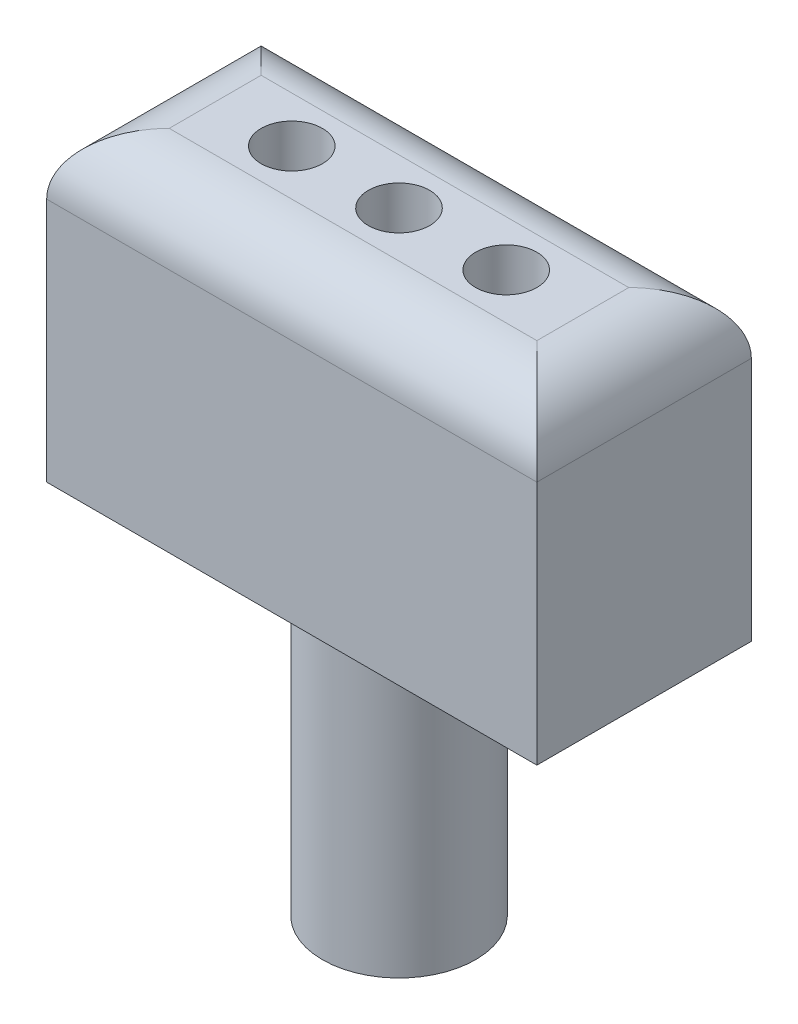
ISO-10303-21;
HEADER;
FILE_DESCRIPTION(('STEP AP214'),'2;1');
FILE_NAME('part.step','',(''),(''),'','','');
FILE_SCHEMA(('AUTOMOTIVE_DESIGN { 1 0 10303 214 1 1 1 1 }'));
ENDSEC;
DATA;
#1=APPLICATION_CONTEXT('core data for automotive mechanical design processes');
#2=APPLICATION_PROTOCOL_DEFINITION('international standard','automotive_design',2000,#1);
#3=PRODUCT_CONTEXT('',#1,'mechanical');
#4=PRODUCT('Part','Part','',(#3));
#5=PRODUCT_RELATED_PRODUCT_CATEGORY('part','',(#4));
#6=PRODUCT_DEFINITION_FORMATION('','',#4);
#7=PRODUCT_DEFINITION_CONTEXT('part definition',#1,'design');
#8=PRODUCT_DEFINITION('design','',#6,#7);
#9=PRODUCT_DEFINITION_SHAPE('','',#8);
#10=(LENGTH_UNIT() NAMED_UNIT(*) SI_UNIT(.MILLI.,.METRE.));
#11=(NAMED_UNIT(*) PLANE_ANGLE_UNIT() SI_UNIT($,.RADIAN.));
#12=(NAMED_UNIT(*) SI_UNIT($,.STERADIAN.) SOLID_ANGLE_UNIT());
#13=UNCERTAINTY_MEASURE_WITH_UNIT(LENGTH_MEASURE(1.E-05),#10,'distance_accuracy_value','');
#14=(GEOMETRIC_REPRESENTATION_CONTEXT(3) GLOBAL_UNCERTAINTY_ASSIGNED_CONTEXT((#13)) GLOBAL_UNIT_ASSIGNED_CONTEXT((#10,
#11,#12)) REPRESENTATION_CONTEXT('',''));
#15=CARTESIAN_POINT('',(0.,0.,0.));
#16=DIRECTION('',(0.,0.,1.));
#17=DIRECTION('',(1.,0.,0.));
#18=AXIS2_PLACEMENT_3D('',#15,#16,#17);
#19=CARTESIAN_POINT('',(0.,50.,0.));
#20=DIRECTION('',(0.,-1.,0.));
#21=DIRECTION('',(0.,0.,-1.));
#22=AXIS2_PLACEMENT_3D('',#19,#20,#21);
#23=CYLINDRICAL_SURFACE('',#22,12.5);
#24=CARTESIAN_POINT('',(0.,50.,0.));
#25=DIRECTION('',(0.,1.,0.));
#26=DIRECTION('',(0.,0.,1.));
#27=AXIS2_PLACEMENT_3D('',#24,#25,#26);
#28=CIRCLE('',#27,12.5);
#29=CARTESIAN_POINT('',(0.,50.,12.5));
#30=VERTEX_POINT('',#29);
#31=EDGE_CURVE('E134',#30,#30,#28,.T.);
#32=ORIENTED_EDGE('',*,*,#31,.F.);
#33=EDGE_LOOP('',(#32));
#34=FACE_BOUND('',#33,.T.);
#35=CARTESIAN_POINT('',(0.,0.,0.));
#36=DIRECTION('',(0.,1.,0.));
#37=DIRECTION('',(0.,0.,1.));
#38=AXIS2_PLACEMENT_3D('',#35,#36,#37);
#39=CIRCLE('',#38,12.5);
#40=CARTESIAN_POINT('',(0.,0.,12.5));
#41=VERTEX_POINT('',#40);
#42=EDGE_CURVE('E105',#41,#41,#39,.T.);
#43=ORIENTED_EDGE('',*,*,#42,.T.);
#44=EDGE_LOOP('',(#43));
#45=FACE_BOUND('',#44,.T.);
#46=ADVANCED_FACE('F45',(#34,#45),#23,.T.);
#47=CARTESIAN_POINT('',(0.,0.,0.));
#48=DIRECTION('',(0.,1.,0.));
#49=DIRECTION('',(0.,0.,1.));
#50=AXIS2_PLACEMENT_3D('',#47,#48,#49);
#51=PLANE('',#50);
#52=ORIENTED_EDGE('',*,*,#42,.F.);
#53=EDGE_LOOP('',(#52));
#54=FACE_BOUND('',#53,.T.);
#55=ADVANCED_FACE('F186',(#54),#51,.F.);
#56=CARTESIAN_POINT('',(40.,100.,-17.5));
#57=DIRECTION('',(-1.,0.,0.));
#58=DIRECTION('',(0.,0.,1.));
#59=AXIS2_PLACEMENT_3D('',#56,#57,#58);
#60=PLANE('',#59);
#61=DIRECTION('',(0.,-1.,0.));
#62=VECTOR('',#61,1.);
#63=CARTESIAN_POINT('',(40.,100.,-17.5));
#64=LINE('',#63,#62);
#65=CARTESIAN_POINT('',(40.,90.,-17.5));
#66=VERTEX_POINT('',#65);
#67=CARTESIAN_POINT('',(40.,50.,-17.5));
#68=VERTEX_POINT('',#67);
#69=EDGE_CURVE('E97',#66,#68,#64,.T.);
#70=ORIENTED_EDGE('',*,*,#69,.F.);
#71=DIRECTION('',(0.,0.,-1.));
#72=VECTOR('',#71,1.);
#73=CARTESIAN_POINT('',(40.,90.,17.5));
#74=LINE('',#73,#72);
#75=CARTESIAN_POINT('',(40.,90.,17.5));
#76=VERTEX_POINT('',#75);
#77=EDGE_CURVE('E11',#66,#76,#74,.F.);
#78=ORIENTED_EDGE('',*,*,#77,.T.);
#79=DIRECTION('',(0.,-1.,0.));
#80=VECTOR('',#79,1.);
#81=CARTESIAN_POINT('',(40.,100.,17.5));
#82=LINE('',#81,#80);
#83=CARTESIAN_POINT('',(40.,50.,17.5));
#84=VERTEX_POINT('',#83);
#85=EDGE_CURVE('E118',#76,#84,#82,.T.);
#86=ORIENTED_EDGE('',*,*,#85,.T.);
#87=DIRECTION('',(0.,0.,-1.));
#88=VECTOR('',#87,1.);
#89=CARTESIAN_POINT('',(40.,50.,-17.5));
#90=LINE('',#89,#88);
#91=EDGE_CURVE('E112',#84,#68,#90,.T.);
#92=ORIENTED_EDGE('',*,*,#91,.T.);
#93=EDGE_LOOP('',(#70,#78,#86,#92));
#94=FACE_BOUND('',#93,.T.);
#95=ADVANCED_FACE('F116',(#94),#60,.F.);
#96=CARTESIAN_POINT('',(-40.,100.,-17.5));
#97=DIRECTION('',(0.,0.,1.));
#98=DIRECTION('',(1.,0.,0.));
#99=AXIS2_PLACEMENT_3D('',#96,#97,#98);
#100=PLANE('',#99);
#101=DIRECTION('',(0.,-1.,0.));
#102=VECTOR('',#101,1.);
#103=CARTESIAN_POINT('',(-40.,100.,-17.5));
#104=LINE('',#103,#102);
#105=CARTESIAN_POINT('',(-40.,90.,-17.5));
#106=VERTEX_POINT('',#105);
#107=CARTESIAN_POINT('',(-40.,50.,-17.5));
#108=VERTEX_POINT('',#107);
#109=EDGE_CURVE('E106',#106,#108,#104,.T.);
#110=ORIENTED_EDGE('',*,*,#109,.F.);
#111=DIRECTION('',(-1.,0.,0.));
#112=VECTOR('',#111,1.);
#113=CARTESIAN_POINT('',(40.,90.,-17.5));
#114=LINE('',#113,#112);
#115=EDGE_CURVE('E54',#106,#66,#114,.F.);
#116=ORIENTED_EDGE('',*,*,#115,.T.);
#117=ORIENTED_EDGE('',*,*,#69,.T.);
#118=DIRECTION('',(-1.,0.,0.));
#119=VECTOR('',#118,1.);
#120=CARTESIAN_POINT('',(-40.,50.,-17.5));
#121=LINE('',#120,#119);
#122=EDGE_CURVE('E100',#68,#108,#121,.T.);
#123=ORIENTED_EDGE('',*,*,#122,.T.);
#124=EDGE_LOOP('',(#110,#116,#117,#123));
#125=FACE_BOUND('',#124,.T.);
#126=ADVANCED_FACE('F99',(#125),#100,.F.);
#127=CARTESIAN_POINT('',(-40.,100.,-17.5));
#128=DIRECTION('',(1.,0.,0.));
#129=DIRECTION('',(0.,0.,-1.));
#130=AXIS2_PLACEMENT_3D('',#127,#128,#129);
#131=PLANE('',#130);
#132=DIRECTION('',(0.,-1.,0.));
#133=VECTOR('',#132,1.);
#134=CARTESIAN_POINT('',(-40.,100.,17.5));
#135=LINE('',#134,#133);
#136=CARTESIAN_POINT('',(-40.,90.,17.5));
#137=VERTEX_POINT('',#136);
#138=CARTESIAN_POINT('',(-40.,50.,17.5));
#139=VERTEX_POINT('',#138);
#140=EDGE_CURVE('E131',#137,#139,#135,.T.);
#141=ORIENTED_EDGE('',*,*,#140,.F.);
#142=DIRECTION('',(0.,0.,1.));
#143=VECTOR('',#142,1.);
#144=CARTESIAN_POINT('',(-40.,90.,-17.5));
#145=LINE('',#144,#143);
#146=EDGE_CURVE('E69',#137,#106,#145,.F.);
#147=ORIENTED_EDGE('',*,*,#146,.T.);
#148=ORIENTED_EDGE('',*,*,#109,.T.);
#149=DIRECTION('',(0.,0.,1.));
#150=VECTOR('',#149,1.);
#151=CARTESIAN_POINT('',(-40.,50.,-17.5));
#152=LINE('',#151,#150);
#153=EDGE_CURVE('E114',#108,#139,#152,.T.);
#154=ORIENTED_EDGE('',*,*,#153,.T.);
#155=EDGE_LOOP('',(#141,#147,#148,#154));
#156=FACE_BOUND('',#155,.T.);
#157=ADVANCED_FACE('F176',(#156),#131,.F.);
#158=CARTESIAN_POINT('',(-40.,100.,17.5));
#159=DIRECTION('',(0.,0.,-1.));
#160=DIRECTION('',(-1.,0.,0.));
#161=AXIS2_PLACEMENT_3D('',#158,#159,#160);
#162=PLANE('',#161);
#163=ORIENTED_EDGE('',*,*,#85,.F.);
#164=DIRECTION('',(1.,0.,0.));
#165=VECTOR('',#164,1.);
#166=CARTESIAN_POINT('',(-40.,90.,17.5));
#167=LINE('',#166,#165);
#168=EDGE_CURVE('E148',#76,#137,#167,.F.);
#169=ORIENTED_EDGE('',*,*,#168,.T.);
#170=ORIENTED_EDGE('',*,*,#140,.T.);
#171=DIRECTION('',(1.,0.,0.));
#172=VECTOR('',#171,1.);
#173=CARTESIAN_POINT('',(-40.,50.,17.5));
#174=LINE('',#173,#172);
#175=EDGE_CURVE('E128',#139,#84,#174,.T.);
#176=ORIENTED_EDGE('',*,*,#175,.T.);
#177=EDGE_LOOP('',(#163,#169,#170,#176));
#178=FACE_BOUND('',#177,.T.);
#179=ADVANCED_FACE('F175',(#178),#162,.F.);
#180=CARTESIAN_POINT('',(0.,100.,0.));
#181=DIRECTION('',(0.,1.,0.));
#182=DIRECTION('',(0.,0.,1.));
#183=AXIS2_PLACEMENT_3D('',#180,#181,#182);
#184=PLANE('',#183);
#185=CARTESIAN_POINT('',(17.5,100.,0.));
#186=DIRECTION('',(0.,1.,0.));
#187=DIRECTION('',(0.,0.,-1.));
#188=AXIS2_PLACEMENT_3D('',#185,#186,#187);
#189=CIRCLE('',#188,5.);
#190=CARTESIAN_POINT('',(17.5,100.,-5.));
#191=VERTEX_POINT('',#190);
#192=EDGE_CURVE('E254',#191,#191,#189,.T.);
#193=ORIENTED_EDGE('',*,*,#192,.F.);
#194=EDGE_LOOP('',(#193));
#195=FACE_BOUND('',#194,.T.);
#196=CARTESIAN_POINT('',(-17.5,100.,0.));
#197=DIRECTION('',(0.,1.,0.));
#198=DIRECTION('',(0.,0.,1.));
#199=AXIS2_PLACEMENT_3D('',#196,#197,#198);
#200=CIRCLE('',#199,5.);
#201=CARTESIAN_POINT('',(-17.5,100.,5.));
#202=VERTEX_POINT('',#201);
#203=EDGE_CURVE('E250',#202,#202,#200,.T.);
#204=ORIENTED_EDGE('',*,*,#203,.F.);
#205=EDGE_LOOP('',(#204));
#206=FACE_BOUND('',#205,.T.);
#207=CARTESIAN_POINT('',(0.,100.,0.));
#208=DIRECTION('',(0.,1.,0.));
#209=DIRECTION('',(0.,0.,1.));
#210=AXIS2_PLACEMENT_3D('',#207,#208,#209);
#211=CIRCLE('',#210,5.);
#212=CARTESIAN_POINT('',(0.,100.,5.));
#213=VERTEX_POINT('',#212);
#214=EDGE_CURVE('E124',#213,#213,#211,.T.);
#215=ORIENTED_EDGE('',*,*,#214,.F.);
#216=EDGE_LOOP('',(#215));
#217=FACE_BOUND('',#216,.T.);
#218=DIRECTION('',(0.,0.,1.));
#219=VECTOR('',#218,1.);
#220=CARTESIAN_POINT('',(-30.,100.,17.5));
#221=LINE('',#220,#219);
#222=CARTESIAN_POINT('',(-30.,100.,-7.5));
#223=VERTEX_POINT('',#222);
#224=CARTESIAN_POINT('',(-30.,100.,7.50000000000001));
#225=VERTEX_POINT('',#224);
#226=EDGE_CURVE('E143',#223,#225,#221,.T.);
#227=ORIENTED_EDGE('',*,*,#226,.T.);
#228=DIRECTION('',(1.,0.,0.));
#229=VECTOR('',#228,1.);
#230=CARTESIAN_POINT('',(40.,100.,7.50000000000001));
#231=LINE('',#230,#229);
#232=CARTESIAN_POINT('',(30.,100.,7.50000000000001));
#233=VERTEX_POINT('',#232);
#234=EDGE_CURVE('E145',#225,#233,#231,.T.);
#235=ORIENTED_EDGE('',*,*,#234,.T.);
#236=DIRECTION('',(0.,0.,-1.));
#237=VECTOR('',#236,1.);
#238=CARTESIAN_POINT('',(30.,100.,-17.5));
#239=LINE('',#238,#237);
#240=CARTESIAN_POINT('',(30.,100.,-7.5));
#241=VERTEX_POINT('',#240);
#242=EDGE_CURVE('E137',#233,#241,#239,.T.);
#243=ORIENTED_EDGE('',*,*,#242,.T.);
#244=DIRECTION('',(-1.,0.,0.));
#245=VECTOR('',#244,1.);
#246=CARTESIAN_POINT('',(-40.,100.,-7.5));
#247=LINE('',#246,#245);
#248=EDGE_CURVE('E141',#241,#223,#247,.T.);
#249=ORIENTED_EDGE('',*,*,#248,.T.);
#250=EDGE_LOOP('',(#227,#235,#243,#249));
#251=FACE_BOUND('',#250,.T.);
#252=ADVANCED_FACE('F168',(#195,#206,#217,#251),#184,.T.);
#253=CARTESIAN_POINT('',(0.,50.,0.));
#254=DIRECTION('',(0.,1.,0.));
#255=DIRECTION('',(0.,0.,1.));
#256=AXIS2_PLACEMENT_3D('',#253,#254,#255);
#257=PLANE('',#256);
#258=ORIENTED_EDGE('',*,*,#31,.T.);
#259=EDGE_LOOP('',(#258));
#260=FACE_BOUND('',#259,.T.);
#261=ORIENTED_EDGE('',*,*,#91,.F.);
#262=ORIENTED_EDGE('',*,*,#175,.F.);
#263=ORIENTED_EDGE('',*,*,#153,.F.);
#264=ORIENTED_EDGE('',*,*,#122,.F.);
#265=EDGE_LOOP('',(#261,#262,#263,#264));
#266=FACE_BOUND('',#265,.T.);
#267=ADVANCED_FACE('F110',(#260,#266),#257,.F.);
#268=CARTESIAN_POINT('',(0.,90.,-7.5));
#269=DIRECTION('',(1.,0.,0.));
#270=DIRECTION('',(0.,0.,-1.));
#271=AXIS2_PLACEMENT_3D('',#268,#269,#270);
#272=CYLINDRICAL_SURFACE('',#271,10.);
#273=CARTESIAN_POINT('',(30.,90.,-7.5));
#274=DIRECTION('',(0.707106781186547,0.,0.707106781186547));
#275=DIRECTION('',(-0.707106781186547,0.,0.707106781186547));
#276=AXIS2_PLACEMENT_3D('',#273,#274,#275);
#277=ELLIPSE('',#276,14.1421356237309,10.);
#278=EDGE_CURVE('E122',#66,#241,#277,.T.);
#279=ORIENTED_EDGE('',*,*,#278,.F.);
#280=ORIENTED_EDGE('',*,*,#115,.F.);
#281=CARTESIAN_POINT('',(-30.,90.,-7.5));
#282=DIRECTION('',(0.707106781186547,0.,-0.707106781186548));
#283=DIRECTION('',(0.707106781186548,0.,0.707106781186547));
#284=AXIS2_PLACEMENT_3D('',#281,#282,#283);
#285=ELLIPSE('',#284,14.142135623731,10.);
#286=EDGE_CURVE('E49',#223,#106,#285,.F.);
#287=ORIENTED_EDGE('',*,*,#286,.F.);
#288=ORIENTED_EDGE('',*,*,#248,.F.);
#289=EDGE_LOOP('',(#279,#280,#287,#288));
#290=FACE_BOUND('',#289,.T.);
#291=ADVANCED_FACE('F47',(#290),#272,.T.);
#292=CARTESIAN_POINT('',(-30.,90.,0.));
#293=DIRECTION('',(0.,0.,-1.));
#294=DIRECTION('',(-1.,0.,0.));
#295=AXIS2_PLACEMENT_3D('',#292,#293,#294);
#296=CYLINDRICAL_SURFACE('',#295,10.);
#297=ORIENTED_EDGE('',*,*,#286,.T.);
#298=ORIENTED_EDGE('',*,*,#146,.F.);
#299=CARTESIAN_POINT('',(-30.,90.,7.50000000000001));
#300=DIRECTION('',(-0.707106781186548,0.,-0.707106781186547));
#301=DIRECTION('',(0.707106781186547,0.,-0.707106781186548));
#302=AXIS2_PLACEMENT_3D('',#299,#300,#301);
#303=ELLIPSE('',#302,14.1421356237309,10.);
#304=EDGE_CURVE('E155',#225,#137,#303,.F.);
#305=ORIENTED_EDGE('',*,*,#304,.F.);
#306=ORIENTED_EDGE('',*,*,#226,.F.);
#307=EDGE_LOOP('',(#297,#298,#305,#306));
#308=FACE_BOUND('',#307,.T.);
#309=ADVANCED_FACE('F202',(#308),#296,.T.);
#310=CARTESIAN_POINT('',(30.,90.,0.));
#311=DIRECTION('',(0.,0.,1.));
#312=DIRECTION('',(1.,0.,0.));
#313=AXIS2_PLACEMENT_3D('',#310,#311,#312);
#314=CYLINDRICAL_SURFACE('',#313,10.);
#315=ORIENTED_EDGE('',*,*,#278,.T.);
#316=ORIENTED_EDGE('',*,*,#242,.F.);
#317=CARTESIAN_POINT('',(30.,90.,7.50000000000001));
#318=DIRECTION('',(-0.707106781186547,0.,0.707106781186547));
#319=DIRECTION('',(0.707106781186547,0.,0.707106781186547));
#320=AXIS2_PLACEMENT_3D('',#317,#318,#319);
#321=ELLIPSE('',#320,14.1421356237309,10.);
#322=EDGE_CURVE('E153',#76,#233,#321,.T.);
#323=ORIENTED_EDGE('',*,*,#322,.F.);
#324=ORIENTED_EDGE('',*,*,#77,.F.);
#325=EDGE_LOOP('',(#315,#316,#323,#324));
#326=FACE_BOUND('',#325,.T.);
#327=ADVANCED_FACE('F161',(#326),#314,.T.);
#328=CARTESIAN_POINT('',(0.,90.,7.50000000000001));
#329=DIRECTION('',(-1.,0.,0.));
#330=DIRECTION('',(0.,0.,1.));
#331=AXIS2_PLACEMENT_3D('',#328,#329,#330);
#332=CYLINDRICAL_SURFACE('',#331,10.);
#333=ORIENTED_EDGE('',*,*,#304,.T.);
#334=ORIENTED_EDGE('',*,*,#168,.F.);
#335=ORIENTED_EDGE('',*,*,#322,.T.);
#336=ORIENTED_EDGE('',*,*,#234,.F.);
#337=EDGE_LOOP('',(#333,#334,#335,#336));
#338=FACE_BOUND('',#337,.T.);
#339=ADVANCED_FACE('F172',(#338),#332,.T.);
#340=CARTESIAN_POINT('',(0.,90.,0.));
#341=DIRECTION('',(0.,1.,0.));
#342=DIRECTION('',(0.,0.,1.));
#343=AXIS2_PLACEMENT_3D('',#340,#341,#342);
#344=CYLINDRICAL_SURFACE('',#343,5.);
#345=CARTESIAN_POINT('',(0.,90.,0.));
#346=DIRECTION('',(0.,1.,0.));
#347=DIRECTION('',(0.,0.,1.));
#348=AXIS2_PLACEMENT_3D('',#345,#346,#347);
#349=CIRCLE('',#348,5.);
#350=CARTESIAN_POINT('',(0.,90.,5.));
#351=VERTEX_POINT('',#350);
#352=EDGE_CURVE('E156',#351,#351,#349,.T.);
#353=ORIENTED_EDGE('',*,*,#352,.F.);
#354=EDGE_LOOP('',(#353));
#355=FACE_BOUND('',#354,.T.);
#356=ORIENTED_EDGE('',*,*,#214,.T.);
#357=EDGE_LOOP('',(#356));
#358=FACE_BOUND('',#357,.T.);
#359=ADVANCED_FACE('F200',(#355,#358),#344,.F.);
#360=CARTESIAN_POINT('',(0.,90.,0.));
#361=DIRECTION('',(0.,1.,0.));
#362=DIRECTION('',(0.,0.,1.));
#363=AXIS2_PLACEMENT_3D('',#360,#361,#362);
#364=PLANE('',#363);
#365=ORIENTED_EDGE('',*,*,#352,.T.);
#366=EDGE_LOOP('',(#365));
#367=FACE_BOUND('',#366,.T.);
#368=ADVANCED_FACE('F222',(#367),#364,.T.);
#369=CARTESIAN_POINT('',(-17.5,90.,0.));
#370=DIRECTION('',(0.,1.,0.));
#371=DIRECTION('',(0.,0.,1.));
#372=AXIS2_PLACEMENT_3D('',#369,#370,#371);
#373=CYLINDRICAL_SURFACE('',#372,5.);
#374=CARTESIAN_POINT('',(-17.5,90.,0.));
#375=DIRECTION('',(0.,1.,0.));
#376=DIRECTION('',(0.,0.,1.));
#377=AXIS2_PLACEMENT_3D('',#374,#375,#376);
#378=CIRCLE('',#377,5.);
#379=CARTESIAN_POINT('',(-17.5,90.,5.));
#380=VERTEX_POINT('',#379);
#381=EDGE_CURVE('E247',#380,#380,#378,.T.);
#382=ORIENTED_EDGE('',*,*,#381,.F.);
#383=EDGE_LOOP('',(#382));
#384=FACE_BOUND('',#383,.T.);
#385=ORIENTED_EDGE('',*,*,#203,.T.);
#386=EDGE_LOOP('',(#385));
#387=FACE_BOUND('',#386,.T.);
#388=ADVANCED_FACE('F226',(#384,#387),#373,.F.);
#389=CARTESIAN_POINT('',(-17.5,90.,0.));
#390=DIRECTION('',(0.,1.,0.));
#391=DIRECTION('',(0.,0.,1.));
#392=AXIS2_PLACEMENT_3D('',#389,#390,#391);
#393=PLANE('',#392);
#394=ORIENTED_EDGE('',*,*,#381,.T.);
#395=EDGE_LOOP('',(#394));
#396=FACE_BOUND('',#395,.T.);
#397=ADVANCED_FACE('F235',(#396),#393,.T.);
#398=CARTESIAN_POINT('',(17.5,90.,0.));
#399=DIRECTION('',(0.,1.,0.));
#400=DIRECTION('',(0.,0.,1.));
#401=AXIS2_PLACEMENT_3D('',#398,#399,#400);
#402=CYLINDRICAL_SURFACE('',#401,5.);
#403=CARTESIAN_POINT('',(17.5,90.,0.));
#404=DIRECTION('',(0.,1.,0.));
#405=DIRECTION('',(0.,0.,-1.));
#406=AXIS2_PLACEMENT_3D('',#403,#404,#405);
#407=CIRCLE('',#406,5.);
#408=CARTESIAN_POINT('',(17.5,90.,-5.));
#409=VERTEX_POINT('',#408);
#410=EDGE_CURVE('E259',#409,#409,#407,.T.);
#411=ORIENTED_EDGE('',*,*,#410,.F.);
#412=EDGE_LOOP('',(#411));
#413=FACE_BOUND('',#412,.T.);
#414=ORIENTED_EDGE('',*,*,#192,.T.);
#415=EDGE_LOOP('',(#414));
#416=FACE_BOUND('',#415,.T.);
#417=ADVANCED_FACE('F231',(#413,#416),#402,.F.);
#418=CARTESIAN_POINT('',(17.5,90.,0.));
#419=DIRECTION('',(0.,-1.,0.));
#420=DIRECTION('',(0.,0.,-1.));
#421=AXIS2_PLACEMENT_3D('',#418,#419,#420);
#422=PLANE('',#421);
#423=ORIENTED_EDGE('',*,*,#410,.T.);
#424=EDGE_LOOP('',(#423));
#425=FACE_BOUND('',#424,.T.);
#426=ADVANCED_FACE('F228',(#425),#422,.F.);
#427=CLOSED_SHELL('',(#46,#55,#95,#126,#157,#179,#252,#267,#291,#309,#327,#339,#359,#368,#388,
#397,#417,#426));
#428=MANIFOLD_SOLID_BREP('B2',#427);
#429=ADVANCED_BREP_SHAPE_REPRESENTATION('',(#18,#428),#14);
#430=SHAPE_DEFINITION_REPRESENTATION(#9,#429);
ENDSEC;
END-ISO-10303-21;
